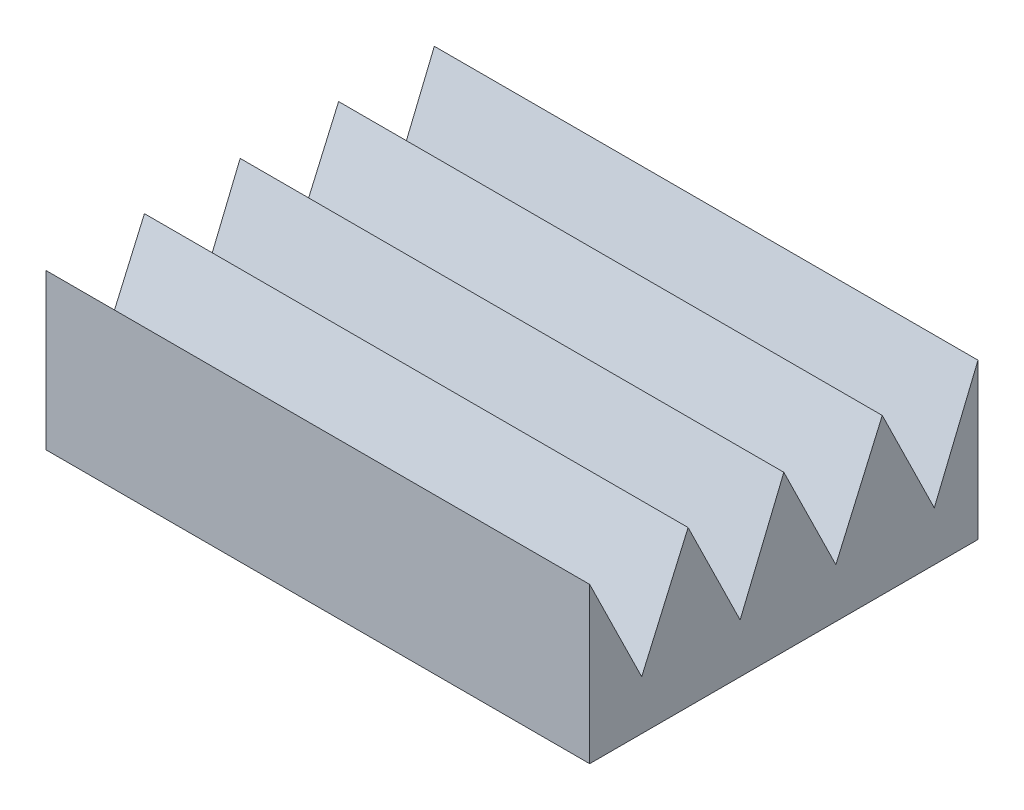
from build123d import *

# Parameters (mm, degrees)
SKETCH1_W           = 70
SKETCH1_H           = 50
BOSS_EXTRUDE1_DEPTH = 20
CUT_EXTRUDE1_DEPTH  = 89.317608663


with BuildPart() as part:
    # Sketch1 → Boss-Extrude1 (new body)
    with BuildSketch(Plane(origin=(0, 0, 0), x_dir=(1, 0, 0), z_dir=(0, 1, 0))):
        with Locations((35, -25)):
            Rectangle(SKETCH1_W, SKETCH1_H)
    extrude(amount=BOSS_EXTRUDE1_DEPTH)

    # Sketch2 → Cut-Extrude1 (cut, through all)
    with BuildSketch(Plane(origin=(70, 0, 0), x_dir=(0, 0, -1), z_dir=(1, 0, 0))):
        Polygon((-50, 20), (0, 20), (-5.627137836, 6.345019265), (-12.325555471, 20), (-18.301582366, 6.345019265), (-25, 20), (-30.627137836, 6.345019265), (-37.325555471, 20), (-43.301582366, 6.345019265), align=None)
    extrude(amount=-CUT_EXTRUDE1_DEPTH, mode=Mode.SUBTRACT)


solid = part.part
